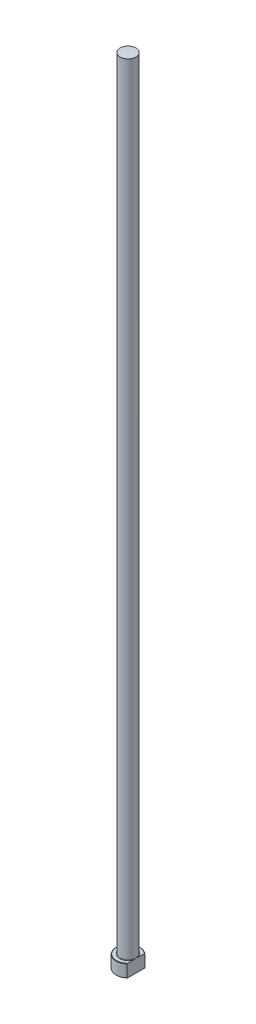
ISO-10303-21;
HEADER;
FILE_DESCRIPTION(('STEP AP214'),'2;1');
FILE_NAME('part.step','',(''),(''),'','','');
FILE_SCHEMA(('AUTOMOTIVE_DESIGN { 1 0 10303 214 1 1 1 1 }'));
ENDSEC;
DATA;
#1=APPLICATION_CONTEXT('core data for automotive mechanical design processes');
#2=APPLICATION_PROTOCOL_DEFINITION('international standard','automotive_design',2000,#1);
#3=PRODUCT_CONTEXT('',#1,'mechanical');
#4=PRODUCT('Part','Part','',(#3));
#5=PRODUCT_RELATED_PRODUCT_CATEGORY('part','',(#4));
#6=PRODUCT_DEFINITION_FORMATION('','',#4);
#7=PRODUCT_DEFINITION_CONTEXT('part definition',#1,'design');
#8=PRODUCT_DEFINITION('design','',#6,#7);
#9=PRODUCT_DEFINITION_SHAPE('','',#8);
#10=(LENGTH_UNIT() NAMED_UNIT(*) SI_UNIT(.MILLI.,.METRE.));
#11=(NAMED_UNIT(*) PLANE_ANGLE_UNIT() SI_UNIT($,.RADIAN.));
#12=(NAMED_UNIT(*) SI_UNIT($,.STERADIAN.) SOLID_ANGLE_UNIT());
#13=UNCERTAINTY_MEASURE_WITH_UNIT(LENGTH_MEASURE(1.E-05),#10,'distance_accuracy_value','');
#14=(GEOMETRIC_REPRESENTATION_CONTEXT(3) GLOBAL_UNCERTAINTY_ASSIGNED_CONTEXT((#13)) GLOBAL_UNIT_ASSIGNED_CONTEXT((#10,
#11,#12)) REPRESENTATION_CONTEXT('',''));
#15=CARTESIAN_POINT('',(0.,0.,0.));
#16=DIRECTION('',(0.,0.,1.));
#17=DIRECTION('',(1.,0.,0.));
#18=AXIS2_PLACEMENT_3D('',#15,#16,#17);
#19=CARTESIAN_POINT('',(0.,0.,0.));
#20=DIRECTION('',(0.,-1.,0.));
#21=DIRECTION('',(0.,0.,-1.));
#22=AXIS2_PLACEMENT_3D('',#19,#20,#21);
#23=PLANE('',#22);
#24=CARTESIAN_POINT('',(0.,0.,0.));
#25=DIRECTION('',(0.,-1.,0.));
#26=DIRECTION('',(0.,0.,-1.));
#27=AXIS2_PLACEMENT_3D('',#24,#25,#26);
#28=CIRCLE('',#27,7.29999999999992);
#29=CARTESIAN_POINT('',(4.99999999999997,0.,5.3188344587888));
#30=VERTEX_POINT('',#29);
#31=CARTESIAN_POINT('',(4.99999999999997,0.,-5.3188344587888));
#32=VERTEX_POINT('',#31);
#33=EDGE_CURVE('E98',#30,#32,#28,.T.);
#34=ORIENTED_EDGE('',*,*,#33,.T.);
#35=DIRECTION('',(0.,0.,1.));
#36=VECTOR('',#35,1.);
#37=CARTESIAN_POINT('',(4.99999999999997,0.,5.59016994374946));
#38=LINE('',#37,#36);
#39=EDGE_CURVE('E83',#32,#30,#38,.T.);
#40=ORIENTED_EDGE('',*,*,#39,.T.);
#41=EDGE_LOOP('',(#34,#40));
#42=FACE_BOUND('',#41,.T.);
#43=ADVANCED_FACE('F32',(#42),#23,.T.);
#44=CARTESIAN_POINT('',(0.,259.958771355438,0.));
#45=DIRECTION('',(0.,1.,0.));
#46=DIRECTION('',(0.,0.,1.));
#47=AXIS2_PLACEMENT_3D('',#44,#45,#46);
#48=CYLINDRICAL_SURFACE('',#47,7.49999999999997);
#49=CARTESIAN_POINT('',(0.,7.80000000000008,0.));
#50=DIRECTION('',(0.,1.,0.));
#51=DIRECTION('',(0.,0.,1.));
#52=AXIS2_PLACEMENT_3D('',#49,#50,#51);
#53=CIRCLE('',#52,7.49999999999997);
#54=CARTESIAN_POINT('',(4.99999999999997,7.80000000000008,5.59016994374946));
#55=VERTEX_POINT('',#54);
#56=CARTESIAN_POINT('',(4.99999999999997,7.80000000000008,-5.59016994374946));
#57=VERTEX_POINT('',#56);
#58=EDGE_CURVE('E104',#55,#57,#53,.F.);
#59=ORIENTED_EDGE('',*,*,#58,.T.);
#60=DIRECTION('',(0.,-1.,0.));
#61=VECTOR('',#60,1.);
#62=CARTESIAN_POINT('',(4.99999999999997,500.,-5.59016994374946));
#63=LINE('',#62,#61);
#64=CARTESIAN_POINT('',(4.99999999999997,0.200000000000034,-5.59016994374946));
#65=VERTEX_POINT('',#64);
#66=EDGE_CURVE('E183',#57,#65,#63,.T.);
#67=ORIENTED_EDGE('',*,*,#66,.T.);
#68=CARTESIAN_POINT('',(0.,0.200000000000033,0.));
#69=DIRECTION('',(0.,-1.,0.));
#70=DIRECTION('',(0.,0.,-1.));
#71=AXIS2_PLACEMENT_3D('',#68,#69,#70);
#72=CIRCLE('',#71,7.49999999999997);
#73=CARTESIAN_POINT('',(4.99999999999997,0.200000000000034,5.59016994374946));
#74=VERTEX_POINT('',#73);
#75=EDGE_CURVE('E100',#65,#74,#72,.F.);
#76=ORIENTED_EDGE('',*,*,#75,.T.);
#77=DIRECTION('',(0.,-1.,0.));
#78=VECTOR('',#77,1.);
#79=CARTESIAN_POINT('',(4.99999999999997,500.,5.59016994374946));
#80=LINE('',#79,#78);
#81=EDGE_CURVE('E93',#55,#74,#80,.T.);
#82=ORIENTED_EDGE('',*,*,#81,.F.);
#83=EDGE_LOOP('',(#59,#67,#76,#82));
#84=FACE_BOUND('',#83,.T.);
#85=ADVANCED_FACE('F158',(#84),#48,.T.);
#86=CARTESIAN_POINT('',(-7.49999999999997,8.,0.));
#87=DIRECTION('',(0.,1.,0.));
#88=DIRECTION('',(0.,0.,1.));
#89=AXIS2_PLACEMENT_3D('',#86,#87,#88);
#90=PLANE('',#89);
#91=CARTESIAN_POINT('',(0.,8.,0.));
#92=DIRECTION('',(0.,1.,0.));
#93=DIRECTION('',(0.,0.,1.));
#94=AXIS2_PLACEMENT_3D('',#91,#92,#93);
#95=CIRCLE('',#94,7.30000000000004);
#96=CARTESIAN_POINT('',(4.99999999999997,8.,-5.31883445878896));
#97=VERTEX_POINT('',#96);
#98=CARTESIAN_POINT('',(4.99999999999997,8.,5.31883445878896));
#99=VERTEX_POINT('',#98);
#100=EDGE_CURVE('E178',#97,#99,#95,.T.);
#101=ORIENTED_EDGE('',*,*,#100,.T.);
#102=DIRECTION('',(0.,0.,-1.));
#103=VECTOR('',#102,1.);
#104=CARTESIAN_POINT('',(4.99999999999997,8.,0.));
#105=LINE('',#104,#103);
#106=CARTESIAN_POINT('',(4.99999999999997,7.99999999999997,1.75783958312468));
#107=VERTEX_POINT('',#106);
#108=EDGE_CURVE('E57',#99,#107,#105,.T.);
#109=ORIENTED_EDGE('',*,*,#108,.T.);
#110=CARTESIAN_POINT('',(0.,8.,0.));
#111=DIRECTION('',(0.,1.,0.));
#112=DIRECTION('',(0.,0.,1.));
#113=AXIS2_PLACEMENT_3D('',#110,#111,#112);
#114=CIRCLE('',#113,5.29999999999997);
#115=CARTESIAN_POINT('',(4.99999999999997,7.99999999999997,-1.75783958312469));
#116=VERTEX_POINT('',#115);
#117=EDGE_CURVE('E107',#107,#116,#114,.F.);
#118=ORIENTED_EDGE('',*,*,#117,.T.);
#119=EDGE_CURVE('E136',#116,#97,#105,.T.);
#120=ORIENTED_EDGE('',*,*,#119,.T.);
#121=EDGE_LOOP('',(#101,#109,#118,#120));
#122=FACE_BOUND('',#121,.T.);
#123=ADVANCED_FACE('F147',(#122),#90,.T.);
#124=CARTESIAN_POINT('',(0.,8.00000000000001,0.));
#125=DIRECTION('',(0.,-1.,0.));
#126=DIRECTION('',(0.,0.,-1.));
#127=AXIS2_PLACEMENT_3D('',#124,#125,#126);
#128=CONICAL_SURFACE('',#127,7.30000000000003,0.785398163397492);
#129=ORIENTED_EDGE('',*,*,#58,.F.);
#130=CARTESIAN_POINT('',(4.99999999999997,2.02290246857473,12.2996471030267));
#131=CARTESIAN_POINT('',(4.99999999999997,2.19416619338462,12.1147698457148));
#132=CARTESIAN_POINT('',(4.99999999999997,2.36513873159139,11.9296229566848));
#133=CARTESIAN_POINT('',(4.99999999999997,2.70641198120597,11.5587086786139));
#134=CARTESIAN_POINT('',(4.99999999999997,2.87671268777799,11.3729412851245));
#135=CARTESIAN_POINT('',(4.99999999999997,3.38654214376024,10.8145105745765));
#136=CARTESIAN_POINT('',(4.99999999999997,3.7249246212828,10.4407980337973));
#137=CARTESIAN_POINT('',(4.99999999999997,4.39960399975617,9.68746107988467));
#138=CARTESIAN_POINT('',(4.99999999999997,4.73587640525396,9.30781469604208));
#139=CARTESIAN_POINT('',(4.99999999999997,5.40266300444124,8.54355414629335));
#140=CARTESIAN_POINT('',(4.99999999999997,5.73317787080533,8.15894056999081));
#141=CARTESIAN_POINT('',(4.99999999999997,6.32050616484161,7.4605234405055));
#142=CARTESIAN_POINT('',(4.99999999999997,6.57881367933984,7.14797875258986));
#143=CARTESIAN_POINT('',(4.99999999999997,7.08815745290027,6.51684714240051));
#144=CARTESIAN_POINT('',(4.99999999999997,7.33919194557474,6.19825878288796));
#145=CARTESIAN_POINT('',(4.99999999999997,7.70761642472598,5.71446312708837));
#146=CARTESIAN_POINT('',(4.99999999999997,7.8290058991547,5.55230264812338));
#147=CARTESIAN_POINT('',(4.99999999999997,8.06851378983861,5.22558802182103));
#148=CARTESIAN_POINT('',(4.99999999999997,8.18663235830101,5.06103398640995));
#149=CARTESIAN_POINT('',(4.99999999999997,8.4187985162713,4.7291634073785));
#150=CARTESIAN_POINT('',(4.99999999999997,8.5328476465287,4.56184794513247));
#151=CARTESIAN_POINT('',(4.99999999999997,8.75590299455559,4.22389957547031));
#152=CARTESIAN_POINT('',(4.99999999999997,8.86490976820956,4.05326703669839));
#153=CARTESIAN_POINT('',(4.99999999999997,9.07352802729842,3.71301730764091));
#154=CARTESIAN_POINT('',(4.99999999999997,9.17331912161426,3.54351083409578));
#155=CARTESIAN_POINT('',(4.99999999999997,9.36528183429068,3.20017857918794));
#156=CARTESIAN_POINT('',(4.99999999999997,9.45745260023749,3.02635231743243));
#157=CARTESIAN_POINT('',(4.99999999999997,9.63197812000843,2.67392882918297));
#158=CARTESIAN_POINT('',(4.99999999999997,9.71433885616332,2.49533459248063));
#159=CARTESIAN_POINT('',(4.99999999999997,9.86657328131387,2.13287211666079));
#160=CARTESIAN_POINT('',(4.99999999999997,9.93645048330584,1.94900537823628));
#161=CARTESIAN_POINT('',(4.99999999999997,10.0468845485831,1.61681363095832));
#162=CARTESIAN_POINT('',(4.99999999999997,10.090511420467,1.46951511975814));
#163=CARTESIAN_POINT('',(4.99999999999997,10.1664777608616,1.17205123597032));
#164=CARTESIAN_POINT('',(4.99999999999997,10.1988213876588,1.02188694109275));
#165=CARTESIAN_POINT('',(4.99999999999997,10.2506360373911,0.719811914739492));
#166=CARTESIAN_POINT('',(4.99999999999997,10.2701475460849,0.567908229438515));
#167=CARTESIAN_POINT('',(4.99999999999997,10.2953955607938,0.26294984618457));
#168=CARTESIAN_POINT('',(4.99999999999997,10.3011328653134,0.109895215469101));
#169=CARTESIAN_POINT('',(4.99999999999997,10.2984919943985,-0.196515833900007));
#170=CARTESIAN_POINT('',(4.99999999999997,10.2900745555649,-0.349871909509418));
#171=CARTESIAN_POINT('',(4.99999999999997,10.2595435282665,-0.655203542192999));
#172=CARTESIAN_POINT('',(4.99999999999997,10.237428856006,-0.8071789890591));
#173=CARTESIAN_POINT('',(4.99999999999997,10.1805990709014,-1.10921231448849));
#174=CARTESIAN_POINT('',(4.99999999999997,10.1458448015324,-1.25926271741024));
#175=CARTESIAN_POINT('',(4.99999999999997,10.0653312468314,-1.55634789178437));
#176=CARTESIAN_POINT('',(4.99999999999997,10.0195714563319,-1.70338252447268));
#177=CARTESIAN_POINT('',(4.99999999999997,9.91304201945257,-2.0105606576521));
#178=CARTESIAN_POINT('',(4.99999999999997,9.85116243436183,-2.17031597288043));
#179=CARTESIAN_POINT('',(4.99999999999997,9.71797424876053,-2.48585686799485));
#180=CARTESIAN_POINT('',(4.99999999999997,9.64666279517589,-2.64164122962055));
#181=CARTESIAN_POINT('',(4.99999999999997,9.49630859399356,-2.94973647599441));
#182=CARTESIAN_POINT('',(4.99999999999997,9.41725276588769,-3.10204092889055));
#183=CARTESIAN_POINT('',(4.99999999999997,9.25299983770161,-3.40325483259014));
#184=CARTESIAN_POINT('',(4.99999999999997,9.16780351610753,-3.55216471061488));
#185=CARTESIAN_POINT('',(4.99999999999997,8.99132919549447,-3.8488609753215));
#186=CARTESIAN_POINT('',(4.99999999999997,8.89998823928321,-3.99660974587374));
#187=CARTESIAN_POINT('',(4.99999999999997,8.7131451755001,-4.28944502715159));
#188=CARTESIAN_POINT('',(4.99999999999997,8.61764297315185,-4.43453147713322));
#189=CARTESIAN_POINT('',(4.99999999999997,8.3262427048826,-4.86605322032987));
#190=CARTESIAN_POINT('',(4.99999999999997,8.12526518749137,-5.14905611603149));
#191=CARTESIAN_POINT('',(4.99999999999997,7.68947947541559,-5.74150232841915));
#192=CARTESIAN_POINT('',(4.99999999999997,7.45349590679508,-6.05007152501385));
#193=CARTESIAN_POINT('',(4.99999999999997,6.97343103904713,-6.66088013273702));
#194=CARTESIAN_POINT('',(4.99999999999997,6.72934863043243,-6.96311866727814));
#195=CARTESIAN_POINT('',(4.99999999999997,6.23516699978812,-7.56307522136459));
#196=CARTESIAN_POINT('',(4.99999999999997,5.98506253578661,-7.86078890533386));
#197=CARTESIAN_POINT('',(4.99999999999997,5.48054649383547,-8.45254667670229));
#198=CARTESIAN_POINT('',(4.99999999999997,5.22613481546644,-8.74659067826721));
#199=CARTESIAN_POINT('',(4.99999999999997,4.72865534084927,-9.31510244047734));
#200=CARTESIAN_POINT('',(4.99999999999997,4.48576913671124,-9.58972942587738));
#201=CARTESIAN_POINT('',(4.99999999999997,3.9976919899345,-10.1369350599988));
#202=CARTESIAN_POINT('',(4.99999999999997,3.75250100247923,-10.4095136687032));
#203=CARTESIAN_POINT('',(4.99999999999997,3.26075538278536,-10.952472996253));
#204=CARTESIAN_POINT('',(4.99999999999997,3.01420432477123,-11.2228569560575));
#205=CARTESIAN_POINT('',(4.99999999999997,2.51960108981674,-11.7622275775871));
#206=CARTESIAN_POINT('',(4.99999999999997,2.27154897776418,-12.0312142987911));
#207=CARTESIAN_POINT('',(4.99999999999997,2.02290246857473,-12.2996471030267));
#208=B_SPLINE_CURVE_WITH_KNOTS('',3,(#130,#131,#132,#133,#134,#135,#136,#137,#138,#139,#140,
#141,#142,#143,#144,#145,#146,#147,#148,#149,#150,#151,#152,#153,#154,#155,#156,#157,#158,#159,
#160,#161,#162,#163,#164,#165,#166,#167,#168,#169,#170,#171,#172,#173,#174,#175,#176,#177,#178,
#179,#180,#181,#182,#183,#184,#185,#186,#187,#188,#189,#190,#191,#192,#193,#194,#195,#196,#197,
#198,#199,#200,#201,#202,#203,#204,#205,#206,#207),.UNSPECIFIED.,.F.,.F.,(4,2,2,2,2,2,2,2,2,2,2,
2,2,2,2,2,2,2,2,2,2,2,2,2,2,2,2,2,2,2,2,2,2,2,2,2,2,2,4),(0.,0.756040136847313,1.5120857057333,
3.02450144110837,4.54594242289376,6.0672044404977,7.28354986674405,8.50018826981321,
9.10784347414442,9.71547035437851,10.3228646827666,10.9301918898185,11.5201366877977,
12.110147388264,12.6997964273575,13.2892792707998,13.7497741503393,14.2100991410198,
14.6689647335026,15.1278037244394,15.5879175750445,16.0480678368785,16.5096559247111,
16.9712652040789,17.4848523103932,17.9985951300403,18.5132211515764,19.0277820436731,
19.5488073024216,20.0698444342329,21.1108480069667,22.2760591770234,23.4414306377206,
24.6078560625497,25.7743087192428,26.8741673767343,27.9740474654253,29.0717909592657,
30.1694873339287),.UNSPECIFIED.);
#209=EDGE_CURVE('E135',#55,#99,#208,.T.);
#210=ORIENTED_EDGE('',*,*,#209,.T.);
#211=ORIENTED_EDGE('',*,*,#100,.F.);
#212=EDGE_CURVE('E127',#97,#57,#208,.T.);
#213=ORIENTED_EDGE('',*,*,#212,.T.);
#214=EDGE_LOOP('',(#129,#210,#211,#213));
#215=FACE_BOUND('',#214,.T.);
#216=ADVANCED_FACE('F143',(#215),#128,.T.);
#217=CARTESIAN_POINT('',(0.,0.200000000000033,0.));
#218=DIRECTION('',(0.,1.,0.));
#219=DIRECTION('',(0.,0.,1.));
#220=AXIS2_PLACEMENT_3D('',#217,#218,#219);
#221=CONICAL_SURFACE('',#220,7.49999999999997,0.785398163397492);
#222=ORIENTED_EDGE('',*,*,#75,.F.);
#223=CARTESIAN_POINT('',(4.99999999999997,5.97709753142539,-12.2996471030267));
#224=CARTESIAN_POINT('',(4.99999999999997,5.8058338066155,-12.1147698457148));
#225=CARTESIAN_POINT('',(4.99999999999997,5.63486126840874,-11.9296229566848));
#226=CARTESIAN_POINT('',(4.99999999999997,5.29358801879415,-11.5587086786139));
#227=CARTESIAN_POINT('',(4.99999999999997,5.12328731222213,-11.3729412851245));
#228=CARTESIAN_POINT('',(4.99999999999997,4.61345785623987,-10.8145105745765));
#229=CARTESIAN_POINT('',(4.99999999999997,4.27507537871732,-10.4407980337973));
#230=CARTESIAN_POINT('',(4.99999999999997,3.60039600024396,-9.68746107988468));
#231=CARTESIAN_POINT('',(4.99999999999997,3.26412359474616,-9.30781469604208));
#232=CARTESIAN_POINT('',(4.99999999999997,2.59733699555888,-8.54355414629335));
#233=CARTESIAN_POINT('',(4.99999999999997,2.26682212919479,-8.15894056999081));
#234=CARTESIAN_POINT('',(4.99999999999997,1.67949383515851,-7.4605234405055));
#235=CARTESIAN_POINT('',(4.99999999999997,1.42118632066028,-7.14797875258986));
#236=CARTESIAN_POINT('',(4.99999999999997,0.91184254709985,-6.51684714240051));
#237=CARTESIAN_POINT('',(4.99999999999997,0.660808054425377,-6.19825878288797));
#238=CARTESIAN_POINT('',(4.99999999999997,0.292383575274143,-5.71446312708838));
#239=CARTESIAN_POINT('',(4.99999999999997,0.17099410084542,-5.55230264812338));
#240=CARTESIAN_POINT('',(4.99999999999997,-0.0685137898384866,-5.22558802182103));
#241=CARTESIAN_POINT('',(4.99999999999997,-0.186632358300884,-5.06103398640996));
#242=CARTESIAN_POINT('',(4.99999999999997,-0.418798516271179,-4.72916340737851));
#243=CARTESIAN_POINT('',(4.99999999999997,-0.532847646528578,-4.56184794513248));
#244=CARTESIAN_POINT('',(4.99999999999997,-0.755902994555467,-4.22389957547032));
#245=CARTESIAN_POINT('',(4.99999999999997,-0.864909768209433,-4.0532670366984));
#246=CARTESIAN_POINT('',(4.99999999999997,-1.0735280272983,-3.71301730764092));
#247=CARTESIAN_POINT('',(4.99999999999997,-1.17331912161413,-3.54351083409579));
#248=CARTESIAN_POINT('',(4.99999999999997,-1.36528183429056,-3.20017857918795));
#249=CARTESIAN_POINT('',(4.99999999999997,-1.45745260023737,-3.02635231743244));
#250=CARTESIAN_POINT('',(4.99999999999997,-1.63197812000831,-2.67392882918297));
#251=CARTESIAN_POINT('',(4.99999999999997,-1.7143388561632,-2.49533459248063));
#252=CARTESIAN_POINT('',(4.99999999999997,-1.86657328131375,-2.1328721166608));
#253=CARTESIAN_POINT('',(4.99999999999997,-1.93645048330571,-1.94900537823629));
#254=CARTESIAN_POINT('',(4.99999999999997,-2.04688454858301,-1.61681363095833));
#255=CARTESIAN_POINT('',(4.99999999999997,-2.0905114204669,-1.46951511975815));
#256=CARTESIAN_POINT('',(4.99999999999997,-2.16647776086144,-1.17205123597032));
#257=CARTESIAN_POINT('',(4.99999999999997,-2.19882138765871,-1.02188694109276));
#258=CARTESIAN_POINT('',(4.99999999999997,-2.25063603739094,-0.719811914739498));
#259=CARTESIAN_POINT('',(4.99999999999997,-2.27014754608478,-0.567908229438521));
#260=CARTESIAN_POINT('',(4.99999999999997,-2.29539556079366,-0.262949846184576));
#261=CARTESIAN_POINT('',(4.99999999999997,-2.30113286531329,-0.109895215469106));
#262=CARTESIAN_POINT('',(4.99999999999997,-2.29849199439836,0.196515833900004));
#263=CARTESIAN_POINT('',(4.99999999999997,-2.29007455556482,0.349871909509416));
#264=CARTESIAN_POINT('',(4.99999999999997,-2.2595435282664,0.655203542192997));
#265=CARTESIAN_POINT('',(4.99999999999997,-2.23742885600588,0.807178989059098));
#266=CARTESIAN_POINT('',(4.99999999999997,-2.18059907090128,1.10921231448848));
#267=CARTESIAN_POINT('',(4.99999999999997,-2.14584480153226,1.25926271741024));
#268=CARTESIAN_POINT('',(4.99999999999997,-2.06533124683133,1.55634789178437));
#269=CARTESIAN_POINT('',(4.99999999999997,-2.01957145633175,1.70338252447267));
#270=CARTESIAN_POINT('',(4.99999999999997,-1.91304201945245,2.01056065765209));
#271=CARTESIAN_POINT('',(4.99999999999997,-1.85116243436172,2.17031597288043));
#272=CARTESIAN_POINT('',(4.99999999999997,-1.71797424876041,2.48585686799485));
#273=CARTESIAN_POINT('',(4.99999999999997,-1.64666279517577,2.64164122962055));
#274=CARTESIAN_POINT('',(4.99999999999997,-1.49630859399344,2.9497364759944));
#275=CARTESIAN_POINT('',(4.99999999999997,-1.41725276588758,3.10204092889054));
#276=CARTESIAN_POINT('',(4.99999999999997,-1.2529998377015,3.40325483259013));
#277=CARTESIAN_POINT('',(4.99999999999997,-1.16780351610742,3.55216471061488));
#278=CARTESIAN_POINT('',(4.99999999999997,-0.991329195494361,3.84886097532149));
#279=CARTESIAN_POINT('',(4.99999999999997,-0.899988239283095,3.99660974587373));
#280=CARTESIAN_POINT('',(4.99999999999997,-0.713145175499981,4.28944502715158));
#281=CARTESIAN_POINT('',(4.99999999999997,-0.617642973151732,4.43453147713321));
#282=CARTESIAN_POINT('',(4.99999999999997,-0.326242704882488,4.86605322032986));
#283=CARTESIAN_POINT('',(4.99999999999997,-0.125265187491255,5.14905611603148));
#284=CARTESIAN_POINT('',(4.99999999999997,0.310520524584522,5.74150232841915));
#285=CARTESIAN_POINT('',(4.99999999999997,0.546504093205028,6.05007152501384));
#286=CARTESIAN_POINT('',(4.99999999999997,1.02656896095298,6.66088013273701));
#287=CARTESIAN_POINT('',(4.99999999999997,1.27065136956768,6.96311866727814));
#288=CARTESIAN_POINT('',(4.99999999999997,1.764833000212,7.56307522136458));
#289=CARTESIAN_POINT('',(4.99999999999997,2.0149374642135,7.86078890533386));
#290=CARTESIAN_POINT('',(4.99999999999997,2.51945350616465,8.45254667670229));
#291=CARTESIAN_POINT('',(4.99999999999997,2.77386518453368,8.74659067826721));
#292=CARTESIAN_POINT('',(4.99999999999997,3.27134465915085,9.31510244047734));
#293=CARTESIAN_POINT('',(4.99999999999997,3.51423086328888,9.58972942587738));
#294=CARTESIAN_POINT('',(4.99999999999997,4.00230801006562,10.1369350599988));
#295=CARTESIAN_POINT('',(4.99999999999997,4.24749899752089,10.4095136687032));
#296=CARTESIAN_POINT('',(4.99999999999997,4.73924461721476,10.952472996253));
#297=CARTESIAN_POINT('',(4.99999999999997,4.98579567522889,11.2228569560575));
#298=CARTESIAN_POINT('',(4.99999999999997,5.48039891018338,11.7622275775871));
#299=CARTESIAN_POINT('',(4.99999999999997,5.72845102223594,12.0312142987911));
#300=CARTESIAN_POINT('',(4.99999999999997,5.97709753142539,12.2996471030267));
#301=B_SPLINE_CURVE_WITH_KNOTS('',3,(#223,#224,#225,#226,#227,#228,#229,#230,#231,#232,#233,
#234,#235,#236,#237,#238,#239,#240,#241,#242,#243,#244,#245,#246,#247,#248,#249,#250,#251,#252,
#253,#254,#255,#256,#257,#258,#259,#260,#261,#262,#263,#264,#265,#266,#267,#268,#269,#270,#271,
#272,#273,#274,#275,#276,#277,#278,#279,#280,#281,#282,#283,#284,#285,#286,#287,#288,#289,#290,
#291,#292,#293,#294,#295,#296,#297,#298,#299,#300),.UNSPECIFIED.,.F.,.F.,(4,2,2,2,2,2,2,2,2,2,2,
2,2,2,2,2,2,2,2,2,2,2,2,2,2,2,2,2,2,2,2,2,2,2,2,2,2,2,4),(0.,0.756040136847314,1.5120857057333,
3.02450144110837,4.54594242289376,6.0672044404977,7.28354986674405,8.50018826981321,
9.10784347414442,9.7154703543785,10.3228646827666,10.9301918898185,11.5201366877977,
12.110147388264,12.6997964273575,13.2892792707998,13.7497741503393,14.2100991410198,
14.6689647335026,15.1278037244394,15.5879175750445,16.0480678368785,16.5096559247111,
16.9712652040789,17.4848523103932,17.9985951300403,18.5132211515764,19.0277820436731,
19.5488073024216,20.0698444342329,21.1108480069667,22.2760591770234,23.4414306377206,
24.6078560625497,25.7743087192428,26.8741673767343,27.9740474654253,29.0717909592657,
30.1694873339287),.UNSPECIFIED.);
#302=EDGE_CURVE('E86',#65,#32,#301,.T.);
#303=ORIENTED_EDGE('',*,*,#302,.T.);
#304=ORIENTED_EDGE('',*,*,#33,.F.);
#305=EDGE_CURVE('E89',#30,#74,#301,.T.);
#306=ORIENTED_EDGE('',*,*,#305,.T.);
#307=EDGE_LOOP('',(#222,#303,#304,#306));
#308=FACE_BOUND('',#307,.T.);
#309=ADVANCED_FACE('F97',(#308),#221,.T.);
#310=CARTESIAN_POINT('',(0.,8.29999999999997,0.));
#311=DIRECTION('',(0.,1.,0.));
#312=DIRECTION('',(0.,0.,1.));
#313=AXIS2_PLACEMENT_3D('',#310,#311,#312);
#314=TOROIDAL_SURFACE('',#313,5.29999999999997,0.3);
#315=CARTESIAN_POINT('',(4.99999999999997,8.29999999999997,0.));
#316=CARTESIAN_POINT('',(4.99999999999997,8.30000062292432,1.3146948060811E-10));
#317=CARTESIAN_POINT('',(4.99999999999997,8.30000124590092,-2.52759224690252E-07));
#318=CARTESIAN_POINT('',(4.99999999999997,8.30000240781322,-9.47164357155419E-07));
#319=CARTESIAN_POINT('',(4.99999999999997,8.30000293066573,-1.40594039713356E-06));
#320=CARTESIAN_POINT('',(4.99999999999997,8.30000402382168,-2.50637608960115E-06));
#321=CARTESIAN_POINT('',(4.99999999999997,8.30000457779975,-3.16588911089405E-06));
#322=CARTESIAN_POINT('',(4.99999999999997,8.30000556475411,-4.52859968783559E-06));
#323=CARTESIAN_POINT('',(4.99999999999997,8.30000600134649,-5.22939450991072E-06));
#324=CARTESIAN_POINT('',(4.99999999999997,8.30000763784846,-7.96121989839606E-06));
#325=CARTESIAN_POINT('',(4.99999999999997,8.30000875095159,-1.00477409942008E-05));
#326=CARTESIAN_POINT('',(4.99999999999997,8.30001056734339,-1.41660874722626E-05));
#327=CARTESIAN_POINT('',(4.99999999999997,8.30001129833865,-1.61861784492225E-05));
#328=CARTESIAN_POINT('',(4.99999999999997,8.30001439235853,-2.4786574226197E-05));
#329=CARTESIAN_POINT('',(4.99999999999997,8.30001672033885,-3.13830284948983E-05));
#330=CARTESIAN_POINT('',(4.99999999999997,8.30002012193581,-4.3808422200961E-05));
#331=CARTESIAN_POINT('',(4.99999999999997,8.30002133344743,-4.95992740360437E-05));
#332=CARTESIAN_POINT('',(4.99999999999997,8.30003020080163,-9.27862616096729E-05));
#333=CARTESIAN_POINT('',(4.99999999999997,8.30003696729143,-0.000130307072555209));
#334=CARTESIAN_POINT('',(4.99999999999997,8.30006659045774,-0.000278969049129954));
#335=CARTESIAN_POINT('',(4.99999999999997,8.30009481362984,-0.000389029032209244));
#336=CARTESIAN_POINT('',(4.99999999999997,8.30020506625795,-0.000826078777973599));
#337=CARTESIAN_POINT('',(4.99999999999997,8.3002836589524,-0.00115365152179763));
#338=CARTESIAN_POINT('',(4.99999999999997,8.30059919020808,-0.00245925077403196));
#339=CARTESIAN_POINT('',(4.99999999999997,8.30084048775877,-0.00343651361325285));
#340=CARTESIAN_POINT('',(4.99999999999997,8.30184626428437,-0.00752058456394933));
#341=CARTESIAN_POINT('',(4.99999999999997,8.3026052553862,-0.0106283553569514));
#342=CARTESIAN_POINT('',(4.99999999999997,8.30996461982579,-0.0407482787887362));
#343=CARTESIAN_POINT('',(4.99999999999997,8.31658985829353,-0.0677561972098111));
#344=CARTESIAN_POINT('',(4.99999999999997,8.32953319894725,-0.120688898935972));
#345=CARTESIAN_POINT('',(4.99999999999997,8.33585289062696,-0.146613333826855));
#346=CARTESIAN_POINT('',(4.99999999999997,8.34926050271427,-0.201795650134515));
#347=CARTESIAN_POINT('',(4.99999999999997,8.35634306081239,-0.231054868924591));
#348=CARTESIAN_POINT('',(4.99999999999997,8.37050252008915,-0.289917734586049));
#349=CARTESIAN_POINT('',(4.99999999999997,8.3775784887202,-0.319521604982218));
#350=CARTESIAN_POINT('',(4.99999999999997,8.39452602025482,-0.391032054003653));
#351=CARTESIAN_POINT('',(4.99999999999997,8.40434071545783,-0.432952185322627));
#352=CARTESIAN_POINT('',(4.99999999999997,8.42340141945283,-0.515763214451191));
#353=CARTESIAN_POINT('',(4.99999999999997,8.43265559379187,-0.556652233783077));
#354=CARTESIAN_POINT('',(4.99999999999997,8.45710553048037,-0.667075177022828));
#355=CARTESIAN_POINT('',(4.99999999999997,8.47194176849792,-0.736689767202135));
#356=CARTESIAN_POINT('',(4.99999999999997,8.50018229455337,-0.876836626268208));
#357=CARTESIAN_POINT('',(4.99999999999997,8.51357312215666,-0.947371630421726));
#358=CARTESIAN_POINT('',(4.99999999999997,8.53930921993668,-1.09497328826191));
#359=CARTESIAN_POINT('',(4.99999999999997,8.55146217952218,-1.17207432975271));
#360=CARTESIAN_POINT('',(4.99999999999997,8.5723966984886,-1.32672649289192));
#361=CARTESIAN_POINT('',(4.99999999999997,8.58117877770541,-1.4042775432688));
#362=CARTESIAN_POINT('',(4.99999999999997,8.59499725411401,-1.56873827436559));
#363=CARTESIAN_POINT('',(4.99999999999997,8.59948802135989,-1.65570044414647));
#364=CARTESIAN_POINT('',(4.99999999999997,8.60018885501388,-1.78535304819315));
#365=CARTESIAN_POINT('',(4.99999999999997,8.59945214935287,-1.82802575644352));
#366=CARTESIAN_POINT('',(4.99999999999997,8.59559364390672,-1.91325081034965));
#367=CARTESIAN_POINT('',(4.99999999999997,8.59247319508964,-1.95580321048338));
#368=CARTESIAN_POINT('',(4.99999999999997,8.58383242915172,-2.03512365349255));
#369=CARTESIAN_POINT('',(4.99999999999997,8.57867386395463,-2.07192937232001));
#370=CARTESIAN_POINT('',(4.99999999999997,8.56543793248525,-2.14526756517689));
#371=CARTESIAN_POINT('',(4.99999999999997,8.55734203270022,-2.18179676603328));
#372=CARTESIAN_POINT('',(4.99999999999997,8.53718005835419,-2.25427226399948));
#373=CARTESIAN_POINT('',(4.99999999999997,8.52507057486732,-2.29020746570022));
#374=CARTESIAN_POINT('',(4.99999999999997,8.5027092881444,-2.34223029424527));
#375=CARTESIAN_POINT('',(4.99999999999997,8.49457811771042,-2.35922314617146));
#376=CARTESIAN_POINT('',(4.99999999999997,8.47657809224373,-2.39224900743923));
#377=CARTESIAN_POINT('',(4.99999999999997,8.46671281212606,-2.40828390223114));
#378=CARTESIAN_POINT('',(4.99999999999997,8.44695893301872,-2.43579467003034));
#379=CARTESIAN_POINT('',(4.99999999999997,8.4374587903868,-2.44754592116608));
#380=CARTESIAN_POINT('',(4.99999999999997,8.41677914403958,-2.4694647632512));
#381=CARTESIAN_POINT('',(4.99999999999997,8.40560543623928,-2.47963758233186));
#382=CARTESIAN_POINT('',(4.99999999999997,8.38617750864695,-2.49393642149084));
#383=CARTESIAN_POINT('',(4.99999999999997,8.37851643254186,-2.49886271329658));
#384=CARTESIAN_POINT('',(4.99999999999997,8.36252740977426,-2.50749953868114));
#385=CARTESIAN_POINT('',(4.99999999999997,8.35419984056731,-2.51121075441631));
#386=CARTESIAN_POINT('',(4.99999999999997,8.33690648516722,-2.5171294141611));
#387=CARTESIAN_POINT('',(4.99999999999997,8.32793451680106,-2.51931927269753));
#388=CARTESIAN_POINT('',(4.99999999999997,8.30973576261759,-2.52185978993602));
#389=CARTESIAN_POINT('',(4.99999999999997,8.30050931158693,-2.52221275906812));
#390=CARTESIAN_POINT('',(4.99999999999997,8.2834916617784,-2.52112455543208));
#391=CARTESIAN_POINT('',(4.99999999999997,8.27568322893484,-2.51993178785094));
#392=CARTESIAN_POINT('',(4.99999999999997,8.26036860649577,-2.51628294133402));
#393=CARTESIAN_POINT('',(4.99999999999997,8.25286261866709,-2.51382603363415));
#394=CARTESIAN_POINT('',(4.99999999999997,8.2359026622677,-2.50685484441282));
#395=CARTESIAN_POINT('',(4.99999999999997,8.22661875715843,-2.50192984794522));
#396=CARTESIAN_POINT('',(4.99999999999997,8.20895514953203,-2.4906654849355));
#397=CARTESIAN_POINT('',(4.99999999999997,8.20057756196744,-2.48432291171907));
#398=CARTESIAN_POINT('',(4.99999999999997,8.1798700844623,-2.46645212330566));
#399=CARTESIAN_POINT('',(4.99999999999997,8.16824151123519,-2.45411867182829));
#400=CARTESIAN_POINT('',(4.99999999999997,8.1469246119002,-2.42790849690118));
#401=CARTESIAN_POINT('',(4.99999999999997,8.13723987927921,-2.41402898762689));
#402=CARTESIAN_POINT('',(4.99999999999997,8.11080706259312,-2.37143175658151));
#403=CARTESIAN_POINT('',(4.99999999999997,8.09628770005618,-2.34134703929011));
#404=CARTESIAN_POINT('',(4.99999999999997,8.07130349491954,-2.27940731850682));
#405=CARTESIAN_POINT('',(4.99999999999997,8.06087110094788,-2.24754035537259));
#406=CARTESIAN_POINT('',(4.99999999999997,8.03890359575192,-2.16787245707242));
#407=CARTESIAN_POINT('',(4.99999999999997,8.02913523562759,-2.11959065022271));
#408=CARTESIAN_POINT('',(4.99999999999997,8.01416953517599,-2.02224928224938));
#409=CARTESIAN_POINT('',(4.99999999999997,8.00898637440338,-1.97318778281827));
#410=CARTESIAN_POINT('',(4.99999999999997,8.00220823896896,-1.87635767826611));
#411=CARTESIAN_POINT('',(4.99999999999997,8.00050709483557,-1.82859609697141));
#412=CARTESIAN_POINT('',(4.99999999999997,7.99969104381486,-1.73330165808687));
#413=CARTESIAN_POINT('',(4.99999999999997,8.00056327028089,-1.68576884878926));
#414=CARTESIAN_POINT('',(4.99999999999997,8.00484296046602,-1.57937770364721));
#415=CARTESIAN_POINT('',(4.99999999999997,8.00880932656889,-1.52054285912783));
#416=CARTESIAN_POINT('',(4.99999999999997,8.01925964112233,-1.4031297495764));
#417=CARTESIAN_POINT('',(4.99999999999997,8.02574264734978,-1.34455139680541));
#418=CARTESIAN_POINT('',(4.99999999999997,8.0409008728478,-1.22627662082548));
#419=CARTESIAN_POINT('',(4.99999999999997,8.04962425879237,-1.16658647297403));
#420=CARTESIAN_POINT('',(4.99999999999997,8.0687792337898,-1.04732463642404));
#421=CARTESIAN_POINT('',(4.99999999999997,8.0792152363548,-0.987753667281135));
#422=CARTESIAN_POINT('',(4.99999999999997,8.10551698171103,-0.846936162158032));
#423=CARTESIAN_POINT('',(4.99999999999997,8.12196565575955,-0.765799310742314));
#424=CARTESIAN_POINT('',(4.99999999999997,8.15639716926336,-0.604819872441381));
#425=CARTESIAN_POINT('',(4.99999999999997,8.1743605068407,-0.524973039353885));
#426=CARTESIAN_POINT('',(4.99999999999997,8.20921667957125,-0.374726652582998));
#427=CARTESIAN_POINT('',(4.99999999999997,8.22599388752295,-0.304300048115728));
#428=CARTESIAN_POINT('',(4.99999999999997,8.25191105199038,-0.196907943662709));
#429=CARTESIAN_POINT('',(4.99999999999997,8.26090146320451,-0.15990571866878));
#430=CARTESIAN_POINT('',(4.99999999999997,8.27881854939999,-0.0865164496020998));
#431=CARTESIAN_POINT('',(4.99999999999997,8.28774391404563,-0.0501291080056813));
#432=CARTESIAN_POINT('',(4.99999999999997,8.29739627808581,-0.0106218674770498));
#433=CARTESIAN_POINT('',(4.99999999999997,8.29815688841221,-0.00750762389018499));
#434=CARTESIAN_POINT('',(4.99999999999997,8.29916304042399,-0.00342209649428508));
#435=CARTESIAN_POINT('',(4.99999999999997,8.29940309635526,-0.00244985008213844));
#436=CARTESIAN_POINT('',(4.99999999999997,8.29971711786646,-0.00115049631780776));
#437=CARTESIAN_POINT('',(4.99999999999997,8.29979541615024,-0.000824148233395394));
#438=CARTESIAN_POINT('',(4.99999999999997,8.29990531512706,-0.000388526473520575));
#439=CARTESIAN_POINT('',(4.99999999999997,8.29993348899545,-0.000278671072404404));
#440=CARTESIAN_POINT('',(4.99999999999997,8.2999630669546,-0.000130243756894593));
#441=CARTESIAN_POINT('',(4.99999999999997,8.29996982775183,-9.27511380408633E-05));
#442=CARTESIAN_POINT('',(4.99999999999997,8.29997868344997,-4.95929890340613E-05));
#443=CARTESIAN_POINT('',(4.99999999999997,8.29997989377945,-4.38036556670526E-05));
#444=CARTESIAN_POINT('',(4.99999999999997,8.29998329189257,-3.1381418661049E-05));
#445=CARTESIAN_POINT('',(4.99999999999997,8.2999856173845,-2.47865220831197E-05));
#446=CARTESIAN_POINT('',(4.99999999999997,8.29998870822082,-1.61877547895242E-05));
#447=CARTESIAN_POINT('',(4.99999999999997,8.29998943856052,-1.4167776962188E-05));
#448=CARTESIAN_POINT('',(4.99999999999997,8.29999125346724,-1.00495531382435E-05));
#449=CARTESIAN_POINT('',(4.99999999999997,8.29999236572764,-7.96302663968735E-06));
#450=CARTESIAN_POINT('',(4.99999999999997,8.29999400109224,-5.23107421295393E-06));
#451=CARTESIAN_POINT('',(4.99999999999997,8.29999443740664,-4.53021037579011E-06));
#452=CARTESIAN_POINT('',(4.99999999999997,8.29999542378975,-3.16731158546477E-06));
#453=CARTESIAN_POINT('',(4.99999999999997,8.29999597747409,-2.5076772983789E-06));
#454=CARTESIAN_POINT('',(4.99999999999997,8.29999707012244,-1.406958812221E-06));
#455=CARTESIAN_POINT('',(4.99999999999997,8.29999759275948,-9.48032461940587E-07));
#456=CARTESIAN_POINT('',(4.99999999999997,8.29999875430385,-2.53244332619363E-07));
#457=CARTESIAN_POINT('',(4.99999999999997,8.29999937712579,-1.31458893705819E-10));
#458=CARTESIAN_POINT('',(4.99999999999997,8.29999999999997,0.));
#459=B_SPLINE_CURVE_WITH_KNOTS('',3,(#315,#316,#317,#318,#319,#320,#321,#322,#323,#324,#325,
#326,#327,#328,#329,#330,#331,#332,#333,#334,#335,#336,#337,#338,#339,#340,#341,#342,#343,#344,
#345,#346,#347,#348,#349,#350,#351,#352,#353,#354,#355,#356,#357,#358,#359,#360,#361,#362,#363,
#364,#365,#366,#367,#368,#369,#370,#371,#372,#373,#374,#375,#376,#377,#378,#379,#380,#381,#382,
#383,#384,#385,#386,#387,#388,#389,#390,#391,#392,#393,#394,#395,#396,#397,#398,#399,#400,#401,
#402,#403,#404,#405,#406,#407,#408,#409,#410,#411,#412,#413,#414,#415,#416,#417,#418,#419,#420,
#421,#422,#423,#424,#425,#426,#427,#428,#429,#430,#431,#432,#433,#434,#435,#436,#437,#438,#439,
#440,#441,#442,#443,#444,#445,#446,#447,#448,#449,#450,#451,#452,#453,#454,#455,#456,#457,#458),
.UNSPECIFIED.,.T.,.F.,(4,2,2,2,2,2,2,2,2,2,2,2,2,2,2,2,2,2,2,2,2,2,2,2,2,2,2,2,2,2,2,2,2,2,2,2,
2,2,2,2,2,2,2,2,2,2,2,2,2,2,2,2,2,2,2,2,2,2,2,2,2,2,2,2,2,2,2,2,2,2,2,4),(0.,
1.88939299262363E-06,3.98058884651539E-06,6.54818523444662E-06,9.024043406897E-06,
1.60938744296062E-05,2.25328190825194E-05,4.3484391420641E-05,6.12120190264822E-05,
0.000175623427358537,0.000516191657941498,0.00152710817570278,0.00454656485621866,
0.0141443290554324,0.0975679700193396,0.177619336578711,0.267931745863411,0.359245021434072,
0.488405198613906,0.614173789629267,0.827694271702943,1.04305715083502,1.27715608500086,
1.51121890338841,1.77214751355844,1.90013509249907,2.028050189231,2.13945459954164,
2.25157451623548,2.36494894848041,2.42139235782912,2.47772074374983,2.52293802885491,
2.56800219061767,2.59524342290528,2.6224693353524,2.65000494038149,2.67750590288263,
2.70108948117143,2.72468854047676,2.75603978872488,2.78746268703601,2.83802806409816,
2.88868607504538,2.98834295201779,3.08877575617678,3.23618650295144,3.38405153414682,
3.52733651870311,3.66990630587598,3.84673903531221,4.02350562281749,4.20444776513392,
4.38586374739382,4.63419556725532,4.87971270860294,5.09690175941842,5.21113882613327,
5.32353360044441,5.33315137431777,5.33615533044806,5.33716246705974,5.33750240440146,
5.3376167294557,5.33763445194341,5.33765539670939,5.33766183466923,5.33766890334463,
5.33767137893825,5.33767394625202,5.33767603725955,5.3376779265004),.UNSPECIFIED.);
#460=CARTESIAN_POINT('',(4.99999999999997,8.29999999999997,0.));
#461=VERTEX_POINT('',#460);
#462=EDGE_CURVE('E11',#116,#461,#459,.T.);
#463=ORIENTED_EDGE('',*,*,#462,.F.);
#464=ORIENTED_EDGE('',*,*,#117,.F.);
#465=CARTESIAN_POINT('',(4.99999999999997,8.29999999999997,0.));
#466=CARTESIAN_POINT('',(4.99999999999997,8.29999937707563,-1.31469481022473E-10));
#467=CARTESIAN_POINT('',(4.99999999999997,8.29999875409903,2.52759224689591E-07));
#468=CARTESIAN_POINT('',(4.99999999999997,8.29999759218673,9.47164357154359E-07));
#469=CARTESIAN_POINT('',(4.99999999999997,8.29999706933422,1.40594039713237E-06));
#470=CARTESIAN_POINT('',(4.99999999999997,8.29999597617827,2.50637608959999E-06));
#471=CARTESIAN_POINT('',(4.99999999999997,8.29999542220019,3.16588911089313E-06));
#472=CARTESIAN_POINT('',(4.99999999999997,8.29999443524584,4.52859968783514E-06));
#473=CARTESIAN_POINT('',(4.99999999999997,8.29999399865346,5.2293945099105E-06));
#474=CARTESIAN_POINT('',(4.99999999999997,8.29999236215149,7.96121989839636E-06));
#475=CARTESIAN_POINT('',(4.99999999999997,8.29999124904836,1.00477409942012E-05));
#476=CARTESIAN_POINT('',(4.99999999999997,8.29998943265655,1.4166087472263E-05));
#477=CARTESIAN_POINT('',(4.99999999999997,8.29998870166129,1.61861784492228E-05));
#478=CARTESIAN_POINT('',(4.99999999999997,8.29998560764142,2.47865742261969E-05));
#479=CARTESIAN_POINT('',(4.99999999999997,8.2999832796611,3.13830284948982E-05));
#480=CARTESIAN_POINT('',(4.99999999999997,8.29997987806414,4.38084222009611E-05));
#481=CARTESIAN_POINT('',(4.99999999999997,8.29997866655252,4.95992740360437E-05));
#482=CARTESIAN_POINT('',(4.99999999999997,8.29996979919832,9.27862616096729E-05));
#483=CARTESIAN_POINT('',(4.99999999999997,8.29996303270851,0.000130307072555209));
#484=CARTESIAN_POINT('',(4.99999999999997,8.29993340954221,0.000278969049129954));
#485=CARTESIAN_POINT('',(4.99999999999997,8.29990518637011,0.000389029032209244));
#486=CARTESIAN_POINT('',(4.99999999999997,8.299794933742,0.000826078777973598));
#487=CARTESIAN_POINT('',(4.99999999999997,8.29971634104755,0.00115365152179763));
#488=CARTESIAN_POINT('',(4.99999999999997,8.29940080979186,0.00245925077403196));
#489=CARTESIAN_POINT('',(4.99999999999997,8.29915951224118,0.00343651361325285));
#490=CARTESIAN_POINT('',(4.99999999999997,8.29815373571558,0.00752058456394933));
#491=CARTESIAN_POINT('',(4.99999999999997,8.29739474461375,0.0106283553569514));
#492=CARTESIAN_POINT('',(4.99999999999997,8.29003538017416,0.0407482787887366));
#493=CARTESIAN_POINT('',(4.99999999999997,8.28341014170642,0.067756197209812));
#494=CARTESIAN_POINT('',(4.99999999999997,8.2704668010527,0.120688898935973));
#495=CARTESIAN_POINT('',(4.99999999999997,8.26414710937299,0.146613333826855));
#496=CARTESIAN_POINT('',(4.99999999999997,8.25073949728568,0.201795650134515));
#497=CARTESIAN_POINT('',(4.99999999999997,8.24365693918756,0.231054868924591));
#498=CARTESIAN_POINT('',(4.99999999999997,8.2294974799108,0.28991773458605));
#499=CARTESIAN_POINT('',(4.99999999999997,8.22242151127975,0.319521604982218));
#500=CARTESIAN_POINT('',(4.99999999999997,8.20547397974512,0.391032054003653));
#501=CARTESIAN_POINT('',(4.99999999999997,8.19565928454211,0.432952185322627));
#502=CARTESIAN_POINT('',(4.99999999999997,8.17659858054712,0.515763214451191));
#503=CARTESIAN_POINT('',(4.99999999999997,8.16734440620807,0.556652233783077));
#504=CARTESIAN_POINT('',(4.99999999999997,8.14289446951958,0.667075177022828));
#505=CARTESIAN_POINT('',(4.99999999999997,8.12805823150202,0.736689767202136));
#506=CARTESIAN_POINT('',(4.99999999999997,8.09981770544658,0.876836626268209));
#507=CARTESIAN_POINT('',(4.99999999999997,8.08642687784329,0.947371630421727));
#508=CARTESIAN_POINT('',(4.99999999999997,8.06069078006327,1.09497328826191));
#509=CARTESIAN_POINT('',(4.99999999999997,8.04853782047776,1.17207432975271));
#510=CARTESIAN_POINT('',(4.99999999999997,8.02760330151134,1.32672649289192));
#511=CARTESIAN_POINT('',(4.99999999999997,8.01882122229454,1.4042775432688));
#512=CARTESIAN_POINT('',(4.99999999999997,8.00500274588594,1.56873827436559));
#513=CARTESIAN_POINT('',(4.99999999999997,8.00051197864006,1.65570044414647));
#514=CARTESIAN_POINT('',(4.99999999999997,7.99981114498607,1.78535304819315));
#515=CARTESIAN_POINT('',(4.99999999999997,8.00054785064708,1.82802575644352));
#516=CARTESIAN_POINT('',(4.99999999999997,8.00440635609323,1.91325081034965));
#517=CARTESIAN_POINT('',(4.99999999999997,8.00752680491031,1.95580321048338));
#518=CARTESIAN_POINT('',(4.99999999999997,8.01616757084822,2.03512365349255));
#519=CARTESIAN_POINT('',(4.99999999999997,8.02132613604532,2.07192937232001));
#520=CARTESIAN_POINT('',(4.99999999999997,8.03456206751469,2.14526756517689));
#521=CARTESIAN_POINT('',(4.99999999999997,8.04265796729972,2.18179676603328));
#522=CARTESIAN_POINT('',(4.99999999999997,8.06281994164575,2.25427226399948));
#523=CARTESIAN_POINT('',(4.99999999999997,8.07492942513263,2.29020746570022));
#524=CARTESIAN_POINT('',(4.99999999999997,8.09729071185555,2.34223029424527));
#525=CARTESIAN_POINT('',(4.99999999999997,8.10542188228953,2.35922314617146));
#526=CARTESIAN_POINT('',(4.99999999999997,8.12342190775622,2.39224900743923));
#527=CARTESIAN_POINT('',(4.99999999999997,8.13328718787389,2.40828390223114));
#528=CARTESIAN_POINT('',(4.99999999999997,8.15304106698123,2.43579467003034));
#529=CARTESIAN_POINT('',(4.99999999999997,8.16254120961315,2.44754592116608));
#530=CARTESIAN_POINT('',(4.99999999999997,8.18322085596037,2.4694647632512));
#531=CARTESIAN_POINT('',(4.99999999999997,8.19439456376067,2.47963758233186));
#532=CARTESIAN_POINT('',(4.99999999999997,8.213822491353,2.49393642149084));
#533=CARTESIAN_POINT('',(4.99999999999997,8.22148356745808,2.49886271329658));
#534=CARTESIAN_POINT('',(4.99999999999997,8.23747259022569,2.50749953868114));
#535=CARTESIAN_POINT('',(4.99999999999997,8.24580015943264,2.51121075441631));
#536=CARTESIAN_POINT('',(4.99999999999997,8.26309351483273,2.5171294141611));
#537=CARTESIAN_POINT('',(4.99999999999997,8.27206548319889,2.51931927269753));
#538=CARTESIAN_POINT('',(4.99999999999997,8.29026423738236,2.52185978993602));
#539=CARTESIAN_POINT('',(4.99999999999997,8.29949068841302,2.52221275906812));
#540=CARTESIAN_POINT('',(4.99999999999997,8.31650833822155,2.52112455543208));
#541=CARTESIAN_POINT('',(4.99999999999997,8.32431677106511,2.51993178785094));
#542=CARTESIAN_POINT('',(4.99999999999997,8.33963139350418,2.51628294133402));
#543=CARTESIAN_POINT('',(4.99999999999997,8.34713738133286,2.51382603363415));
#544=CARTESIAN_POINT('',(4.99999999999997,8.36409733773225,2.50685484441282));
#545=CARTESIAN_POINT('',(4.99999999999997,8.37338124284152,2.50192984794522));
#546=CARTESIAN_POINT('',(4.99999999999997,8.39104485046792,2.4906654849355));
#547=CARTESIAN_POINT('',(4.99999999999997,8.39942243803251,2.48432291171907));
#548=CARTESIAN_POINT('',(4.99999999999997,8.42012991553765,2.46645212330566));
#549=CARTESIAN_POINT('',(4.99999999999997,8.43175848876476,2.45411867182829));
#550=CARTESIAN_POINT('',(4.99999999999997,8.45307538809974,2.42790849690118));
#551=CARTESIAN_POINT('',(4.99999999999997,8.46276012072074,2.41402898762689));
#552=CARTESIAN_POINT('',(4.99999999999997,8.48919293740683,2.37143175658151));
#553=CARTESIAN_POINT('',(4.99999999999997,8.50371229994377,2.34134703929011));
#554=CARTESIAN_POINT('',(4.99999999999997,8.52869650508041,2.27940731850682));
#555=CARTESIAN_POINT('',(4.99999999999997,8.53912889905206,2.24754035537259));
#556=CARTESIAN_POINT('',(4.99999999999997,8.56109640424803,2.16787245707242));
#557=CARTESIAN_POINT('',(4.99999999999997,8.57086476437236,2.11959065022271));
#558=CARTESIAN_POINT('',(4.99999999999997,8.58583046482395,2.02224928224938));
#559=CARTESIAN_POINT('',(4.99999999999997,8.59101362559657,1.97318778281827));
#560=CARTESIAN_POINT('',(4.99999999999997,8.59779176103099,1.87635767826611));
#561=CARTESIAN_POINT('',(4.99999999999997,8.59949290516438,1.82859609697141));
#562=CARTESIAN_POINT('',(4.99999999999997,8.60030895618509,1.73330165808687));
#563=CARTESIAN_POINT('',(4.99999999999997,8.59943672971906,1.68576884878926));
#564=CARTESIAN_POINT('',(4.99999999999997,8.59515703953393,1.57937770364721));
#565=CARTESIAN_POINT('',(4.99999999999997,8.59119067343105,1.52054285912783));
#566=CARTESIAN_POINT('',(4.99999999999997,8.58074035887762,1.4031297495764));
#567=CARTESIAN_POINT('',(4.99999999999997,8.57425735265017,1.34455139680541));
#568=CARTESIAN_POINT('',(4.99999999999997,8.55909912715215,1.22627662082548));
#569=CARTESIAN_POINT('',(4.99999999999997,8.55037574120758,1.16658647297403));
#570=CARTESIAN_POINT('',(4.99999999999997,8.53122076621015,1.04732463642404));
#571=CARTESIAN_POINT('',(4.99999999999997,8.52078476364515,0.987753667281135));
#572=CARTESIAN_POINT('',(4.99999999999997,8.49448301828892,0.846936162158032));
#573=CARTESIAN_POINT('',(4.99999999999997,8.4780343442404,0.765799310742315));
#574=CARTESIAN_POINT('',(4.99999999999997,8.44360283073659,0.604819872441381));
#575=CARTESIAN_POINT('',(4.99999999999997,8.42563949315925,0.524973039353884));
#576=CARTESIAN_POINT('',(4.99999999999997,8.39078332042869,0.374726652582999));
#577=CARTESIAN_POINT('',(4.99999999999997,8.37400611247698,0.304300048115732));
#578=CARTESIAN_POINT('',(4.99999999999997,8.34808894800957,0.196907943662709));
#579=CARTESIAN_POINT('',(4.99999999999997,8.33909853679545,0.159905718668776));
#580=CARTESIAN_POINT('',(4.99999999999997,8.32118145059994,0.0865164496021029));
#581=CARTESIAN_POINT('',(4.99999999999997,8.31225608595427,0.0501291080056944));
#582=CARTESIAN_POINT('',(4.99999999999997,8.30260372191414,0.0106218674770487));
#583=CARTESIAN_POINT('',(4.99999999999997,8.30184311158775,0.00750762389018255));
#584=CARTESIAN_POINT('',(4.99999999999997,8.30083695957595,0.00342209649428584));
#585=CARTESIAN_POINT('',(4.99999999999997,8.30059690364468,0.00244985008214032));
#586=CARTESIAN_POINT('',(4.99999999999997,8.30028288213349,0.00115049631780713));
#587=CARTESIAN_POINT('',(4.99999999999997,8.30020458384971,0.000824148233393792));
#588=CARTESIAN_POINT('',(4.99999999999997,8.30009468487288,0.000388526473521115));
#589=CARTESIAN_POINT('',(4.99999999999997,8.30006651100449,0.000278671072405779));
#590=CARTESIAN_POINT('',(4.99999999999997,8.30003693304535,0.000130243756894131));
#591=CARTESIAN_POINT('',(4.99999999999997,8.30003017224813,9.27511380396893E-05));
#592=CARTESIAN_POINT('',(4.99999999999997,8.30002131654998,4.95929890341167E-05));
#593=CARTESIAN_POINT('',(4.99999999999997,8.3000201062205,4.38036556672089E-05));
#594=CARTESIAN_POINT('',(4.99999999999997,8.30001670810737,3.13814186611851E-05));
#595=CARTESIAN_POINT('',(4.99999999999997,8.30001438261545,2.47865220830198E-05));
#596=CARTESIAN_POINT('',(4.99999999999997,8.30001129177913,1.61877547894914E-05));
#597=CARTESIAN_POINT('',(4.99999999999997,8.30001056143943,1.41677769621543E-05));
#598=CARTESIAN_POINT('',(4.99999999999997,8.30000874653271,1.00495531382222E-05));
#599=CARTESIAN_POINT('',(4.99999999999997,8.30000763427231,7.96302663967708E-06));
#600=CARTESIAN_POINT('',(4.99999999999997,8.30000599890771,5.23107421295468E-06));
#601=CARTESIAN_POINT('',(4.99999999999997,8.3000055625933,4.53021037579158E-06));
#602=CARTESIAN_POINT('',(4.99999999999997,8.3000045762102,3.16731158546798E-06));
#603=CARTESIAN_POINT('',(4.99999999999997,8.30000402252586,2.50767729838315E-06));
#604=CARTESIAN_POINT('',(4.99999999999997,8.30000292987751,1.40695881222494E-06));
#605=CARTESIAN_POINT('',(4.99999999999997,8.30000240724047,9.48032461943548E-07));
#606=CARTESIAN_POINT('',(4.99999999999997,8.30000124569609,2.53244332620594E-07));
#607=CARTESIAN_POINT('',(4.99999999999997,8.30000062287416,1.3145889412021E-10));
#608=CARTESIAN_POINT('',(4.99999999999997,8.29999999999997,0.));
#609=B_SPLINE_CURVE_WITH_KNOTS('',3,(#465,#466,#467,#468,#469,#470,#471,#472,#473,#474,#475,
#476,#477,#478,#479,#480,#481,#482,#483,#484,#485,#486,#487,#488,#489,#490,#491,#492,#493,#494,
#495,#496,#497,#498,#499,#500,#501,#502,#503,#504,#505,#506,#507,#508,#509,#510,#511,#512,#513,
#514,#515,#516,#517,#518,#519,#520,#521,#522,#523,#524,#525,#526,#527,#528,#529,#530,#531,#532,
#533,#534,#535,#536,#537,#538,#539,#540,#541,#542,#543,#544,#545,#546,#547,#548,#549,#550,#551,
#552,#553,#554,#555,#556,#557,#558,#559,#560,#561,#562,#563,#564,#565,#566,#567,#568,#569,#570,
#571,#572,#573,#574,#575,#576,#577,#578,#579,#580,#581,#582,#583,#584,#585,#586,#587,#588,#589,
#590,#591,#592,#593,#594,#595,#596,#597,#598,#599,#600,#601,#602,#603,#604,#605,#606,#607,#608),
.UNSPECIFIED.,.T.,.F.,(4,2,2,2,2,2,2,2,2,2,2,2,2,2,2,2,2,2,2,2,2,2,2,2,2,2,2,2,2,2,2,2,2,2,2,2,
2,2,2,2,2,2,2,2,2,2,2,2,2,2,2,2,2,2,2,2,2,2,2,2,2,2,2,2,2,2,2,2,2,2,2,4),(0.,
1.88939299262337E-06,3.98058884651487E-06,6.54818523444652E-06,9.0240434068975E-06,
1.60938744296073E-05,2.25328190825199E-05,4.34843914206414E-05,6.12120190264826E-05,
0.000175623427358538,0.000516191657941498,0.00152710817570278,0.00454656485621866,
0.0141443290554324,0.0975679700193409,0.177619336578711,0.267931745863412,0.359245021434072,
0.488405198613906,0.614173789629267,0.827694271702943,1.04305715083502,1.27715608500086,
1.51121890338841,1.77214751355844,1.90013509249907,2.028050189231,2.13945459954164,
2.25157451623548,2.36494894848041,2.42139235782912,2.47772074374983,2.52293802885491,
2.56800219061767,2.59524342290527,2.6224693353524,2.65000494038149,2.67750590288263,
2.70108948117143,2.72468854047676,2.75603978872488,2.78746268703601,2.83802806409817,
2.88868607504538,2.98834295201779,3.08877575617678,3.23618650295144,3.38405153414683,
3.52733651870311,3.66990630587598,3.84673903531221,4.02350562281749,4.20444776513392,
4.38586374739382,4.63419556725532,4.87971270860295,5.09690175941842,5.21113882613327,
5.32353360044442,5.33315137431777,5.33615533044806,5.33716246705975,5.33750240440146,
5.33761672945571,5.33763445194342,5.33765539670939,5.33766183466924,5.33766890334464,
5.33767137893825,5.33767394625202,5.33767603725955,5.3376779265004),.UNSPECIFIED.);
#610=EDGE_CURVE('E46',#461,#107,#609,.T.);
#611=ORIENTED_EDGE('',*,*,#610,.F.);
#612=CARTESIAN_POINT('',(0.,8.29999999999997,0.));
#613=DIRECTION('',(0.,1.,0.));
#614=DIRECTION('',(0.,0.,1.));
#615=AXIS2_PLACEMENT_3D('',#612,#613,#614);
#616=CIRCLE('',#615,4.99999999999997);
#617=EDGE_CURVE('E103',#461,#461,#616,.T.);
#618=ORIENTED_EDGE('',*,*,#617,.F.);
#619=EDGE_LOOP('',(#463,#464,#611,#618));
#620=FACE_BOUND('',#619,.T.);
#621=ADVANCED_FACE('F34',(#620),#314,.F.);
#622=CARTESIAN_POINT('',(0.,259.958771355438,0.));
#623=DIRECTION('',(0.,1.,0.));
#624=DIRECTION('',(0.,0.,1.));
#625=AXIS2_PLACEMENT_3D('',#622,#623,#624);
#626=CYLINDRICAL_SURFACE('',#625,4.99999999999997);
#627=ORIENTED_EDGE('',*,*,#617,.T.);
#628=EDGE_LOOP('',(#627));
#629=FACE_BOUND('',#628,.T.);
#630=CARTESIAN_POINT('',(0.,500.,0.));
#631=DIRECTION('',(0.,1.,0.));
#632=DIRECTION('',(0.,0.,1.));
#633=AXIS2_PLACEMENT_3D('',#630,#631,#632);
#634=CIRCLE('',#633,4.99999999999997);
#635=CARTESIAN_POINT('',(0.,500.,4.99999999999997));
#636=VERTEX_POINT('',#635);
#637=EDGE_CURVE('E101',#636,#636,#634,.T.);
#638=ORIENTED_EDGE('',*,*,#637,.F.);
#639=EDGE_LOOP('',(#638));
#640=FACE_BOUND('',#639,.T.);
#641=ADVANCED_FACE('F155',(#629,#640),#626,.T.);
#642=CARTESIAN_POINT('',(-4.99999999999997,500.,0.));
#643=DIRECTION('',(0.,1.,0.));
#644=DIRECTION('',(0.,0.,1.));
#645=AXIS2_PLACEMENT_3D('',#642,#643,#644);
#646=PLANE('',#645);
#647=ORIENTED_EDGE('',*,*,#637,.T.);
#648=EDGE_LOOP('',(#647));
#649=FACE_BOUND('',#648,.T.);
#650=ADVANCED_FACE('F121',(#649),#646,.T.);
#651=CARTESIAN_POINT('',(4.99999999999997,500.,5.59016994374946));
#652=DIRECTION('',(1.,0.,0.));
#653=DIRECTION('',(0.,0.,-1.));
#654=AXIS2_PLACEMENT_3D('',#651,#652,#653);
#655=PLANE('',#654);
#656=ORIENTED_EDGE('',*,*,#66,.F.);
#657=ORIENTED_EDGE('',*,*,#212,.F.);
#658=ORIENTED_EDGE('',*,*,#119,.F.);
#659=ORIENTED_EDGE('',*,*,#462,.T.);
#660=ORIENTED_EDGE('',*,*,#610,.T.);
#661=ORIENTED_EDGE('',*,*,#108,.F.);
#662=ORIENTED_EDGE('',*,*,#209,.F.);
#663=ORIENTED_EDGE('',*,*,#81,.T.);
#664=ORIENTED_EDGE('',*,*,#305,.F.);
#665=ORIENTED_EDGE('',*,*,#39,.F.);
#666=ORIENTED_EDGE('',*,*,#302,.F.);
#667=EDGE_LOOP('',(#656,#657,#658,#659,#660,#661,#662,#663,#664,#665,#666));
#668=FACE_BOUND('',#667,.T.);
#669=ADVANCED_FACE('F85',(#668),#655,.T.);
#670=CLOSED_SHELL('',(#43,#85,#123,#216,#309,#621,#641,#650,#669));
#671=MANIFOLD_SOLID_BREP('B2',#670);
#672=ADVANCED_BREP_SHAPE_REPRESENTATION('',(#18,#671),#14);
#673=SHAPE_DEFINITION_REPRESENTATION(#9,#672);
ENDSEC;
END-ISO-10303-21;
